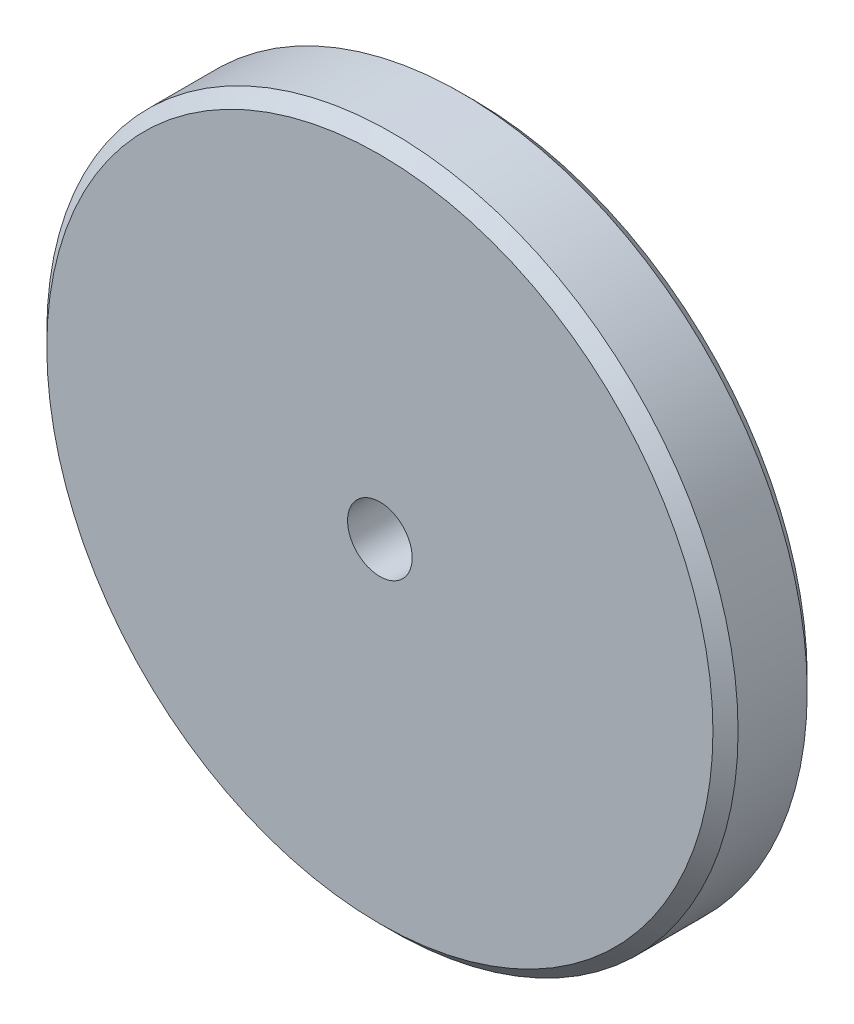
ISO-10303-21;
HEADER;
FILE_DESCRIPTION(('STEP AP214'),'2;1');
FILE_NAME('part.step','',(''),(''),'','','');
FILE_SCHEMA(('AUTOMOTIVE_DESIGN { 1 0 10303 214 1 1 1 1 }'));
ENDSEC;
DATA;
#1=APPLICATION_CONTEXT('core data for automotive mechanical design processes');
#2=APPLICATION_PROTOCOL_DEFINITION('international standard','automotive_design',2000,#1);
#3=PRODUCT_CONTEXT('',#1,'mechanical');
#4=PRODUCT('Part','Part','',(#3));
#5=PRODUCT_RELATED_PRODUCT_CATEGORY('part','',(#4));
#6=PRODUCT_DEFINITION_FORMATION('','',#4);
#7=PRODUCT_DEFINITION_CONTEXT('part definition',#1,'design');
#8=PRODUCT_DEFINITION('design','',#6,#7);
#9=PRODUCT_DEFINITION_SHAPE('','',#8);
#10=(LENGTH_UNIT() NAMED_UNIT(*) SI_UNIT(.MILLI.,.METRE.));
#11=(NAMED_UNIT(*) PLANE_ANGLE_UNIT() SI_UNIT($,.RADIAN.));
#12=(NAMED_UNIT(*) SI_UNIT($,.STERADIAN.) SOLID_ANGLE_UNIT());
#13=UNCERTAINTY_MEASURE_WITH_UNIT(LENGTH_MEASURE(1.E-05),#10,'distance_accuracy_value','');
#14=(GEOMETRIC_REPRESENTATION_CONTEXT(3) GLOBAL_UNCERTAINTY_ASSIGNED_CONTEXT((#13)) GLOBAL_UNIT_ASSIGNED_CONTEXT((#10,
#11,#12)) REPRESENTATION_CONTEXT('',''));
#15=CARTESIAN_POINT('',(0.,0.,0.));
#16=DIRECTION('',(0.,0.,1.));
#17=DIRECTION('',(1.,0.,0.));
#18=AXIS2_PLACEMENT_3D('',#15,#16,#17);
#19=CARTESIAN_POINT('',(0.,0.,9.525));
#20=DIRECTION('',(0.,0.,-1.));
#21=DIRECTION('',(-1.,0.,0.));
#22=AXIS2_PLACEMENT_3D('',#19,#20,#21);
#23=CYLINDRICAL_SURFACE('',#22,34.925);
#24=CARTESIAN_POINT('',(0.,0.,1.27000000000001));
#25=DIRECTION('',(0.,0.,1.));
#26=DIRECTION('',(1.,0.,0.));
#27=AXIS2_PLACEMENT_3D('',#24,#25,#26);
#28=CIRCLE('',#27,34.925);
#29=CARTESIAN_POINT('',(-34.925,0.,1.27000000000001));
#30=VERTEX_POINT('',#29);
#31=EDGE_CURVE('E53',#30,#30,#28,.T.);
#32=CARTESIAN_POINT('',(0.,0.,8.25500000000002));
#33=DIRECTION('',(0.,0.,1.));
#34=DIRECTION('',(1.,0.,0.));
#35=AXIS2_PLACEMENT_3D('',#32,#33,#34);
#36=CIRCLE('',#35,34.925);
#37=CARTESIAN_POINT('',(-34.925,0.,8.25500000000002));
#38=VERTEX_POINT('',#37);
#39=EDGE_CURVE('E58',#38,#38,#36,.F.);
#40=CARTESIAN_POINT('',(-34.925,0.,1.27000000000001));
#41=CARTESIAN_POINT('',(-34.925,0.,1.34276041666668));
#42=CARTESIAN_POINT('',(-34.925,0.,1.41552083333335));
#43=CARTESIAN_POINT('',(-34.925,0.,1.56104166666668));
#44=CARTESIAN_POINT('',(-34.925,0.,1.63380208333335));
#45=CARTESIAN_POINT('',(-34.925,0.,1.77932291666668));
#46=CARTESIAN_POINT('',(-34.925,0.,1.85208333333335));
#47=CARTESIAN_POINT('',(-34.925,0.,1.99760416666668));
#48=CARTESIAN_POINT('',(-34.925,0.,2.07036458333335));
#49=CARTESIAN_POINT('',(-34.925,0.,2.21588541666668));
#50=CARTESIAN_POINT('',(-34.925,0.,2.28864583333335));
#51=CARTESIAN_POINT('',(-34.925,0.,2.43416666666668));
#52=CARTESIAN_POINT('',(-34.925,0.,2.50692708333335));
#53=CARTESIAN_POINT('',(-34.925,0.,2.65244791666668));
#54=CARTESIAN_POINT('',(-34.925,0.,2.72520833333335));
#55=CARTESIAN_POINT('',(-34.925,0.,2.87072916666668));
#56=CARTESIAN_POINT('',(-34.925,0.,2.94348958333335));
#57=CARTESIAN_POINT('',(-34.925,0.,3.08901041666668));
#58=CARTESIAN_POINT('',(-34.925,0.,3.16177083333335));
#59=CARTESIAN_POINT('',(-34.925,0.,3.30729166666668));
#60=CARTESIAN_POINT('',(-34.925,0.,3.38005208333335));
#61=CARTESIAN_POINT('',(-34.925,0.,3.52557291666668));
#62=CARTESIAN_POINT('',(-34.925,0.,3.59833333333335));
#63=CARTESIAN_POINT('',(-34.925,0.,3.74385416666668));
#64=CARTESIAN_POINT('',(-34.925,0.,3.81661458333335));
#65=CARTESIAN_POINT('',(-34.925,0.,3.96213541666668));
#66=CARTESIAN_POINT('',(-34.925,0.,4.03489583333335));
#67=CARTESIAN_POINT('',(-34.925,0.,4.18041666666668));
#68=CARTESIAN_POINT('',(-34.925,0.,4.25317708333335));
#69=CARTESIAN_POINT('',(-34.925,0.,4.39869791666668));
#70=CARTESIAN_POINT('',(-34.925,0.,4.47145833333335));
#71=CARTESIAN_POINT('',(-34.925,0.,4.61697916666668));
#72=CARTESIAN_POINT('',(-34.925,0.,4.68973958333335));
#73=CARTESIAN_POINT('',(-34.925,0.,4.83526041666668));
#74=CARTESIAN_POINT('',(-34.925,0.,4.90802083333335));
#75=CARTESIAN_POINT('',(-34.925,0.,5.05354166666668));
#76=CARTESIAN_POINT('',(-34.925,0.,5.12630208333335));
#77=CARTESIAN_POINT('',(-34.925,0.,5.27182291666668));
#78=CARTESIAN_POINT('',(-34.925,0.,5.34458333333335));
#79=CARTESIAN_POINT('',(-34.925,0.,5.49010416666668));
#80=CARTESIAN_POINT('',(-34.925,0.,5.56286458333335));
#81=CARTESIAN_POINT('',(-34.925,0.,5.70838541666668));
#82=CARTESIAN_POINT('',(-34.925,0.,5.78114583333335));
#83=CARTESIAN_POINT('',(-34.925,0.,5.92666666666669));
#84=CARTESIAN_POINT('',(-34.925,0.,5.99942708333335));
#85=CARTESIAN_POINT('',(-34.925,0.,6.14494791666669));
#86=CARTESIAN_POINT('',(-34.925,0.,6.21770833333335));
#87=CARTESIAN_POINT('',(-34.925,0.,6.36322916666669));
#88=CARTESIAN_POINT('',(-34.925,0.,6.43598958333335));
#89=CARTESIAN_POINT('',(-34.925,0.,6.58151041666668));
#90=CARTESIAN_POINT('',(-34.925,0.,6.65427083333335));
#91=CARTESIAN_POINT('',(-34.925,0.,6.79979166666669));
#92=CARTESIAN_POINT('',(-34.925,0.,6.87255208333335));
#93=CARTESIAN_POINT('',(-34.925,0.,7.01807291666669));
#94=CARTESIAN_POINT('',(-34.925,0.,7.09083333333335));
#95=CARTESIAN_POINT('',(-34.925,0.,7.23635416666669));
#96=CARTESIAN_POINT('',(-34.925,0.,7.30911458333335));
#97=CARTESIAN_POINT('',(-34.925,0.,7.45463541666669));
#98=CARTESIAN_POINT('',(-34.925,0.,7.52739583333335));
#99=CARTESIAN_POINT('',(-34.925,0.,7.67291666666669));
#100=CARTESIAN_POINT('',(-34.925,0.,7.74567708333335));
#101=CARTESIAN_POINT('',(-34.925,0.,7.89119791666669));
#102=CARTESIAN_POINT('',(-34.925,0.,7.96395833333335));
#103=CARTESIAN_POINT('',(-34.925,0.,8.10947916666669));
#104=CARTESIAN_POINT('',(-34.925,0.,8.18223958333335));
#105=CARTESIAN_POINT('',(-34.925,0.,8.25500000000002));
#106=B_SPLINE_CURVE_WITH_KNOTS('',3,(#40,#41,#42,#43,#44,#45,#46,#47,#48,#49,#50,#51,#52,#53,
#54,#55,#56,#57,#58,#59,#60,#61,#62,#63,#64,#65,#66,#67,#68,#69,#70,#71,#72,#73,#74,#75,#76,#77,
#78,#79,#80,#81,#82,#83,#84,#85,#86,#87,#88,#89,#90,#91,#92,#93,#94,#95,#96,#97,#98,#99,#100,
#101,#102,#103,#104,#105),.UNSPECIFIED.,.F.,.F.,(4,2,2,2,2,2,2,2,2,2,2,2,2,2,2,2,2,2,2,2,2,2,2,
2,2,2,2,2,2,2,2,2,4),(0.,0.218281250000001,0.436562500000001,0.65484375,0.873125,1.09140625,
1.3096875,1.52796875,1.74625,1.96453125,2.1828125,2.40109375,2.619375,2.83765625,3.0559375,
3.27421875,3.4925,3.71078125,3.9290625,4.14734375,4.365625,4.58390625,4.8021875,
5.02046875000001,5.23875,5.45703125,5.6753125,5.89359375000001,6.11187500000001,
6.33015625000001,6.54843750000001,6.76671875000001,6.98500000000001),.UNSPECIFIED.);
#107=EDGE_CURVE('BSEAM39',#30,#38,#106,.T.);
#108=ORIENTED_EDGE('',*,*,#31,.T.);
#109=ORIENTED_EDGE('',*,*,#39,.T.);
#110=ORIENTED_EDGE('',*,*,#107,.T.);
#111=ORIENTED_EDGE('',*,*,#107,.F.);
#112=EDGE_LOOP('',(#108,#110,#109,#111));
#113=FACE_BOUND('',#112,.T.);
#114=ADVANCED_FACE('F39',(#113),#23,.T.);
#115=CARTESIAN_POINT('',(0.,0.,9.525));
#116=DIRECTION('',(0.,0.,1.));
#117=DIRECTION('',(1.,0.,0.));
#118=AXIS2_PLACEMENT_3D('',#115,#116,#117);
#119=PLANE('',#118);
#120=CARTESIAN_POINT('',(0.,0.,9.525));
#121=DIRECTION('',(0.,0.,1.));
#122=DIRECTION('',(1.,0.,0.));
#123=AXIS2_PLACEMENT_3D('',#120,#121,#122);
#124=CIRCLE('',#123,3.2639);
#125=CARTESIAN_POINT('',(3.2639,0.,9.525));
#126=VERTEX_POINT('',#125);
#127=EDGE_CURVE('E68',#126,#126,#124,.T.);
#128=ORIENTED_EDGE('',*,*,#127,.F.);
#129=EDGE_LOOP('',(#128));
#130=FACE_BOUND('',#129,.T.);
#131=CARTESIAN_POINT('',(0.,0.,9.525));
#132=DIRECTION('',(0.,0.,1.));
#133=DIRECTION('',(1.,0.,0.));
#134=AXIS2_PLACEMENT_3D('',#131,#132,#133);
#135=CIRCLE('',#134,33.655);
#136=CARTESIAN_POINT('',(33.655,0.,9.525));
#137=VERTEX_POINT('',#136);
#138=EDGE_CURVE('E10',#137,#137,#135,.T.);
#139=ORIENTED_EDGE('',*,*,#138,.T.);
#140=EDGE_LOOP('',(#139));
#141=FACE_BOUND('',#140,.T.);
#142=ADVANCED_FACE('F75',(#130,#141),#119,.T.);
#143=CARTESIAN_POINT('',(0.,0.,0.));
#144=DIRECTION('',(0.,0.,1.));
#145=DIRECTION('',(1.,0.,0.));
#146=AXIS2_PLACEMENT_3D('',#143,#144,#145);
#147=PLANE('',#146);
#148=CARTESIAN_POINT('',(0.,0.,0.));
#149=DIRECTION('',(0.,0.,1.));
#150=DIRECTION('',(1.,0.,0.));
#151=AXIS2_PLACEMENT_3D('',#148,#149,#150);
#152=CIRCLE('',#151,3.2639);
#153=CARTESIAN_POINT('',(3.2639,0.,0.));
#154=VERTEX_POINT('',#153);
#155=EDGE_CURVE('E64',#154,#154,#152,.T.);
#156=ORIENTED_EDGE('',*,*,#155,.T.);
#157=EDGE_LOOP('',(#156));
#158=FACE_BOUND('',#157,.T.);
#159=CARTESIAN_POINT('',(0.,0.,0.));
#160=DIRECTION('',(0.,0.,1.));
#161=DIRECTION('',(1.,0.,0.));
#162=AXIS2_PLACEMENT_3D('',#159,#160,#161);
#163=CIRCLE('',#162,33.655);
#164=CARTESIAN_POINT('',(33.655,0.,0.));
#165=VERTEX_POINT('',#164);
#166=EDGE_CURVE('E48',#165,#165,#163,.F.);
#167=ORIENTED_EDGE('',*,*,#166,.T.);
#168=EDGE_LOOP('',(#167));
#169=FACE_BOUND('',#168,.T.);
#170=ADVANCED_FACE('F77',(#158,#169),#147,.F.);
#171=CARTESIAN_POINT('',(0.,0.,1.27000000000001));
#172=DIRECTION('',(0.,0.,1.));
#173=DIRECTION('',(1.,0.,0.));
#174=AXIS2_PLACEMENT_3D('',#171,#172,#173);
#175=CONICAL_SURFACE('',#174,34.925,0.785398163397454);
#176=ORIENTED_EDGE('',*,*,#166,.F.);
#177=EDGE_LOOP('',(#176));
#178=FACE_BOUND('',#177,.T.);
#179=ORIENTED_EDGE('',*,*,#31,.F.);
#180=EDGE_LOOP('',(#179));
#181=FACE_BOUND('',#180,.T.);
#182=ADVANCED_FACE('F83',(#178,#181),#175,.T.);
#183=CARTESIAN_POINT('',(0.,0.,9.525));
#184=DIRECTION('',(0.,0.,-1.));
#185=DIRECTION('',(-1.,0.,0.));
#186=AXIS2_PLACEMENT_3D('',#183,#184,#185);
#187=CONICAL_SURFACE('',#186,33.655,0.785398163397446);
#188=ORIENTED_EDGE('',*,*,#39,.F.);
#189=EDGE_LOOP('',(#188));
#190=FACE_BOUND('',#189,.T.);
#191=ORIENTED_EDGE('',*,*,#138,.F.);
#192=EDGE_LOOP('',(#191));
#193=FACE_BOUND('',#192,.T.);
#194=ADVANCED_FACE('F42',(#190,#193),#187,.T.);
#195=CARTESIAN_POINT('',(0.,0.,9.525));
#196=DIRECTION('',(0.,0.,1.));
#197=DIRECTION('',(1.,0.,0.));
#198=AXIS2_PLACEMENT_3D('',#195,#196,#197);
#199=CYLINDRICAL_SURFACE('',#198,3.2639);
#200=ORIENTED_EDGE('',*,*,#155,.F.);
#201=EDGE_LOOP('',(#200));
#202=FACE_BOUND('',#201,.T.);
#203=ORIENTED_EDGE('',*,*,#127,.T.);
#204=EDGE_LOOP('',(#203));
#205=FACE_BOUND('',#204,.T.);
#206=ADVANCED_FACE('F73',(#202,#205),#199,.F.);
#207=CLOSED_SHELL('',(#114,#142,#170,#182,#194,#206));
#208=MANIFOLD_SOLID_BREP('B2',#207);
#209=ADVANCED_BREP_SHAPE_REPRESENTATION('',(#18,#208),#14);
#210=SHAPE_DEFINITION_REPRESENTATION(#9,#209);
ENDSEC;
END-ISO-10303-21;
